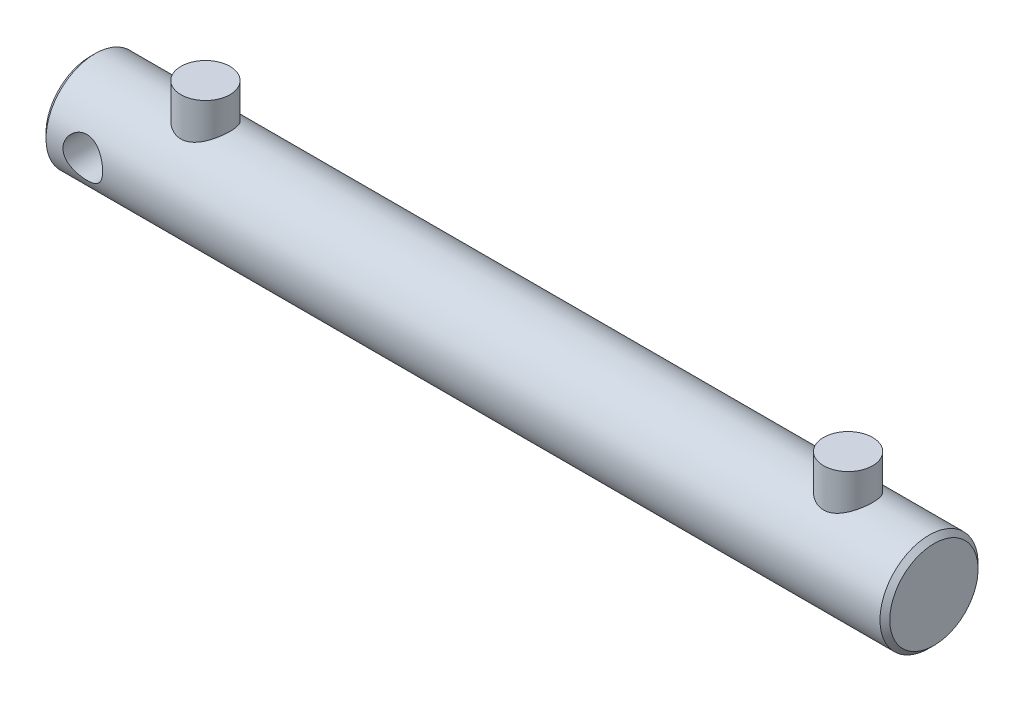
ISO-10303-21;
HEADER;
FILE_DESCRIPTION(('STEP AP214'),'2;1');
FILE_NAME('part.step','',(''),(''),'','','');
FILE_SCHEMA(('AUTOMOTIVE_DESIGN { 1 0 10303 214 1 1 1 1 }'));
ENDSEC;
DATA;
#1=APPLICATION_CONTEXT('core data for automotive mechanical design processes');
#2=APPLICATION_PROTOCOL_DEFINITION('international standard','automotive_design',2000,#1);
#3=PRODUCT_CONTEXT('',#1,'mechanical');
#4=PRODUCT('Part','Part','',(#3));
#5=PRODUCT_RELATED_PRODUCT_CATEGORY('part','',(#4));
#6=PRODUCT_DEFINITION_FORMATION('','',#4);
#7=PRODUCT_DEFINITION_CONTEXT('part definition',#1,'design');
#8=PRODUCT_DEFINITION('design','',#6,#7);
#9=PRODUCT_DEFINITION_SHAPE('','',#8);
#10=(LENGTH_UNIT() NAMED_UNIT(*) SI_UNIT(.MILLI.,.METRE.));
#11=(NAMED_UNIT(*) PLANE_ANGLE_UNIT() SI_UNIT($,.RADIAN.));
#12=(NAMED_UNIT(*) SI_UNIT($,.STERADIAN.) SOLID_ANGLE_UNIT());
#13=UNCERTAINTY_MEASURE_WITH_UNIT(LENGTH_MEASURE(1.E-05),#10,'distance_accuracy_value','');
#14=(GEOMETRIC_REPRESENTATION_CONTEXT(3) GLOBAL_UNCERTAINTY_ASSIGNED_CONTEXT((#13)) GLOBAL_UNIT_ASSIGNED_CONTEXT((#10,
#11,#12)) REPRESENTATION_CONTEXT('',''));
#15=CARTESIAN_POINT('',(0.,0.,0.));
#16=DIRECTION('',(0.,0.,1.));
#17=DIRECTION('',(1.,0.,0.));
#18=AXIS2_PLACEMENT_3D('',#15,#16,#17);
#19=CARTESIAN_POINT('',(-172.,0.,0.));
#20=DIRECTION('',(-1.,0.,0.));
#21=DIRECTION('',(0.,0.,1.));
#22=AXIS2_PLACEMENT_3D('',#19,#20,#21);
#23=CYLINDRICAL_SURFACE('',#22,20.);
#24=CARTESIAN_POINT('',(-125.,17.3205080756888,-9.99999999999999));
#25=CARTESIAN_POINT('',(-125.260663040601,17.3205095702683,-9.99999887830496));
#26=CARTESIAN_POINT('',(-125.521348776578,17.3264124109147,-9.98979463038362));
#27=CARTESIAN_POINT('',(-126.040711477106,17.3498046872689,-9.94911125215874));
#28=CARTESIAN_POINT('',(-126.299387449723,17.3672995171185,-9.91862268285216));
#29=CARTESIAN_POINT('',(-126.813023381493,17.4132568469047,-9.8377155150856));
#30=CARTESIAN_POINT('',(-127.06797685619,17.4417365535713,-9.78726564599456));
#31=CARTESIAN_POINT('',(-127.572049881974,17.5086546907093,-9.66704369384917));
#32=CARTESIAN_POINT('',(-127.821166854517,17.5470974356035,-9.59726323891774));
#33=CARTESIAN_POINT('',(-128.310473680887,17.6323996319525,-9.43962165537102));
#34=CARTESIAN_POINT('',(-128.550706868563,17.6792090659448,-9.3518675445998));
#35=CARTESIAN_POINT('',(-129.022554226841,17.779982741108,-9.15882440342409));
#36=CARTESIAN_POINT('',(-129.254165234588,17.8339495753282,-9.05352901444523));
#37=CARTESIAN_POINT('',(-129.707545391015,17.9475017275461,-8.82628481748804));
#38=CARTESIAN_POINT('',(-129.929316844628,18.007085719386,-8.70433993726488));
#39=CARTESIAN_POINT('',(-130.362159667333,18.1303531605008,-8.44458163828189));
#40=CARTESIAN_POINT('',(-130.573230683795,18.1940367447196,-8.3067676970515));
#41=CARTESIAN_POINT('',(-131.000837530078,18.329363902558,-8.00400718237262));
#42=CARTESIAN_POINT('',(-131.216382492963,18.4012302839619,-7.83775940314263));
#43=CARTESIAN_POINT('',(-131.632934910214,18.5460965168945,-7.48852658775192));
#44=CARTESIAN_POINT('',(-131.833946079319,18.6190960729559,-7.3055458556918));
#45=CARTESIAN_POINT('',(-132.220694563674,18.7644955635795,-6.92354675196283));
#46=CARTESIAN_POINT('',(-132.406419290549,18.836894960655,-6.72451542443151));
#47=CARTESIAN_POINT('',(-132.761346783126,18.9792540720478,-6.31154503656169));
#48=CARTESIAN_POINT('',(-132.930555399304,19.0492146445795,-6.09761130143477));
#49=CARTESIAN_POINT('',(-133.262364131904,19.1896470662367,-5.64077435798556));
#50=CARTESIAN_POINT('',(-133.423739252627,19.2598322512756,-5.39689043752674));
#51=CARTESIAN_POINT('',(-133.725206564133,19.3935808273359,-4.89454568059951));
#52=CARTESIAN_POINT('',(-133.865297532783,19.4571438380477,-4.63608400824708));
#53=CARTESIAN_POINT('',(-134.122748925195,19.5757886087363,-4.10635184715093));
#54=CARTESIAN_POINT('',(-134.240120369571,19.6308744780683,-3.83508764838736));
#55=CARTESIAN_POINT('',(-134.450862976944,19.7309453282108,-3.28159286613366));
#56=CARTESIAN_POINT('',(-134.544236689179,19.775931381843,-2.99936345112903));
#57=CARTESIAN_POINT('',(-134.700028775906,19.8516061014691,-2.44661617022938));
#58=CARTESIAN_POINT('',(-134.764176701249,19.8830841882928,-2.1766933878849));
#59=CARTESIAN_POINT('',(-134.869930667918,19.9352303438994,-1.63143316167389));
#60=CARTESIAN_POINT('',(-134.911537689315,19.9558988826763,-1.35609595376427));
#61=CARTESIAN_POINT('',(-134.971639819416,19.9858180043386,-0.802434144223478));
#62=CARTESIAN_POINT('',(-134.990146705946,19.9950744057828,-0.524111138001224));
#63=CARTESIAN_POINT('',(-135.003828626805,20.001913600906,0.0332441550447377));
#64=CARTESIAN_POINT('',(-134.999005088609,19.9994971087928,0.312276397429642));
#65=CARTESIAN_POINT('',(-134.967536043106,19.9837839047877,0.844365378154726));
#66=CARTESIAN_POINT('',(-134.942827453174,19.9714530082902,1.09756809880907));
#67=CARTESIAN_POINT('',(-134.874317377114,19.9374335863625,1.60072224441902));
#68=CARTESIAN_POINT('',(-134.830517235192,19.9157457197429,1.85067389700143));
#69=CARTESIAN_POINT('',(-134.724300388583,19.8635314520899,2.34564683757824));
#70=CARTESIAN_POINT('',(-134.66188307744,19.8330047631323,2.59066796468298));
#71=CARTESIAN_POINT('',(-134.519069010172,19.7638249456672,3.0742307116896));
#72=CARTESIAN_POINT('',(-134.438671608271,19.7251715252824,3.31277209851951));
#73=CARTESIAN_POINT('',(-134.259427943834,19.6400278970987,3.78519130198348));
#74=CARTESIAN_POINT('',(-134.160345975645,19.5934383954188,4.01896179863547));
#75=CARTESIAN_POINT('',(-133.945309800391,19.4938328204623,4.47722728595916));
#76=CARTESIAN_POINT('',(-133.829349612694,19.4408144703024,4.70171895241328));
#77=CARTESIAN_POINT('',(-133.457485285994,19.2738101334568,5.35951935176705));
#78=CARTESIAN_POINT('',(-133.17748838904,19.1518214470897,5.77743819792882));
#79=CARTESIAN_POINT('',(-132.530959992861,18.8844067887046,6.6018551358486));
#80=CARTESIAN_POINT('',(-132.158750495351,18.7378553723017,7.00353936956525));
#81=CARTESIAN_POINT('',(-131.55536158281,18.5185765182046,7.55658054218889));
#82=CARTESIAN_POINT('',(-131.346548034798,18.4455210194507,7.73279224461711));
#83=CARTESIAN_POINT('',(-130.914677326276,18.301419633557,8.06791510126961));
#84=CARTESIAN_POINT('',(-130.691618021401,18.2303740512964,8.22682364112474));
#85=CARTESIAN_POINT('',(-130.217666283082,18.0878347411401,8.53586780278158));
#86=CARTESIAN_POINT('',(-129.965906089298,18.0166021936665,8.68479491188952));
#87=CARTESIAN_POINT('',(-129.448949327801,17.8810231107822,8.96061518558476));
#88=CARTESIAN_POINT('',(-129.183758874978,17.8166734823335,9.08751826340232));
#89=CARTESIAN_POINT('',(-128.64159710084,17.6972138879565,9.31801905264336));
#90=CARTESIAN_POINT('',(-128.364632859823,17.6420984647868,9.42163054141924));
#91=CARTESIAN_POINT('',(-127.800756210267,17.5432965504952,9.6043511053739));
#92=CARTESIAN_POINT('',(-127.513845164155,17.4996085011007,9.68346352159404));
#93=CARTESIAN_POINT('',(-126.955495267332,17.4285246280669,9.81078056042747));
#94=CARTESIAN_POINT('',(-126.684630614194,17.400112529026,9.86093677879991));
#95=CARTESIAN_POINT('',(-126.13867425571,17.3557653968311,9.93878416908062));
#96=CARTESIAN_POINT('',(-125.863582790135,17.3398296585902,9.96647661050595));
#97=CARTESIAN_POINT('',(-125.311769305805,17.3211203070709,9.99895720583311));
#98=CARTESIAN_POINT('',(-125.035048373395,17.3183387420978,10.0037591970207));
#99=CARTESIAN_POINT('',(-124.482357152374,17.3260388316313,9.99041751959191));
#100=CARTESIAN_POINT('',(-124.206386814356,17.3365195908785,9.97227539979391));
#101=CARTESIAN_POINT('',(-123.687830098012,17.3684286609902,9.91658048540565));
#102=CARTESIAN_POINT('',(-123.444904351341,17.3885290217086,9.8813769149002));
#103=CARTESIAN_POINT('',(-122.963158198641,17.4382137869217,9.79342893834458));
#104=CARTESIAN_POINT('',(-122.724339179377,17.467801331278,9.74067872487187));
#105=CARTESIAN_POINT('',(-122.25237280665,17.5355331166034,9.61821012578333));
#106=CARTESIAN_POINT('',(-122.019224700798,17.5736762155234,9.54849400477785));
#107=CARTESIAN_POINT('',(-121.55977565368,17.6574071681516,9.39275103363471));
#108=CARTESIAN_POINT('',(-121.33347746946,17.7029979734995,9.3067177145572));
#109=CARTESIAN_POINT('',(-120.646161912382,17.8535843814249,9.01657018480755));
#110=CARTESIAN_POINT('',(-120.19832719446,17.9691397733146,8.78600743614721));
#111=CARTESIAN_POINT('',(-119.34518986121,18.2156365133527,8.26280380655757));
#112=CARTESIAN_POINT('',(-118.93990925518,18.3465857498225,7.97013103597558));
#113=CARTESIAN_POINT('',(-118.344589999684,18.5540860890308,7.46888401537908));
#114=CARTESIAN_POINT('',(-118.137806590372,18.6294365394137,7.27935116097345));
#115=CARTESIAN_POINT('',(-117.740757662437,18.7793184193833,6.88345408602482));
#116=CARTESIAN_POINT('',(-117.550487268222,18.8538500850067,6.6770948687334));
#117=CARTESIAN_POINT('',(-117.18740551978,19.0002370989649,6.2483870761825));
#118=CARTESIAN_POINT('',(-117.014607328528,19.0720904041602,6.02602665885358));
#119=CARTESIAN_POINT('',(-116.687849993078,19.2111944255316,5.5666478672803));
#120=CARTESIAN_POINT('',(-116.533882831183,19.2784470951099,5.32963579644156));
#121=CARTESIAN_POINT('',(-116.2420643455,19.4083463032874,4.83560208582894));
#122=CARTESIAN_POINT('',(-116.104754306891,19.4708214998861,4.5782147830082));
#123=CARTESIAN_POINT('',(-115.852529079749,19.5873354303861,4.05082787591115));
#124=CARTESIAN_POINT('',(-115.737614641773,19.6413738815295,3.78082784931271));
#125=CARTESIAN_POINT('',(-115.531567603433,19.7393769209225,3.23033940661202));
#126=CARTESIAN_POINT('',(-115.440418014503,19.7833487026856,2.94985864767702));
#127=CARTESIAN_POINT('',(-115.282980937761,19.8599022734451,2.38049331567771));
#128=CARTESIAN_POINT('',(-115.216690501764,19.8924854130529,2.09160974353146));
#129=CARTESIAN_POINT('',(-115.114810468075,19.9427983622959,1.53480500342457));
#130=CARTESIAN_POINT('',(-115.076961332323,19.9616170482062,1.26739371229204));
#131=CARTESIAN_POINT('',(-115.023013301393,19.9884894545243,0.729851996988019));
#132=CARTESIAN_POINT('',(-115.006913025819,19.9965438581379,0.459721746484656));
#133=CARTESIAN_POINT('',(-114.996673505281,20.0016629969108,-0.0809759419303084));
#134=CARTESIAN_POINT('',(-115.002527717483,19.998731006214,-0.351543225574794));
#135=CARTESIAN_POINT('',(-115.036105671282,19.9819662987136,-0.89097156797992));
#136=CARTESIAN_POINT('',(-115.063828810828,19.9681338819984,-1.1598326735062));
#137=CARTESIAN_POINT('',(-115.13824007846,19.9312153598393,-1.67605139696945));
#138=CARTESIAN_POINT('',(-115.18355535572,19.9088004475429,-1.92365683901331));
#139=CARTESIAN_POINT('',(-115.292457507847,19.8553300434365,-2.41384547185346));
#140=CARTESIAN_POINT('',(-115.356043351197,19.8242750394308,-2.6564289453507));
#141=CARTESIAN_POINT('',(-115.500847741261,19.7542370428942,-3.13506320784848));
#142=CARTESIAN_POINT('',(-115.582064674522,19.7152547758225,-3.37111459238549));
#143=CARTESIAN_POINT('',(-115.761430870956,19.6302044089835,-3.83546861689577));
#144=CARTESIAN_POINT('',(-115.859586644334,19.5841335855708,-4.06376823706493));
#145=CARTESIAN_POINT('',(-116.076518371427,19.483810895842,-4.52085803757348));
#146=CARTESIAN_POINT('',(-116.1959918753,19.4292950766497,-4.74925902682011));
#147=CARTESIAN_POINT('',(-116.451565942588,19.3148302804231,-5.19522438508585));
#148=CARTESIAN_POINT('',(-116.587672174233,19.2548794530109,-5.41278502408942));
#149=CARTESIAN_POINT('',(-116.875596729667,19.1308402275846,-5.83606045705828));
#150=CARTESIAN_POINT('',(-117.027418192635,19.0667510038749,-6.04177287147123));
#151=CARTESIAN_POINT('',(-117.345875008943,18.9358010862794,-6.44045588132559));
#152=CARTESIAN_POINT('',(-117.5125111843,18.8689402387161,-6.63342576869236));
#153=CARTESIAN_POINT('',(-117.877095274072,18.7271146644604,-7.02443076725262));
#154=CARTESIAN_POINT('',(-118.076508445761,18.6520069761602,-7.22105023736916));
#155=CARTESIAN_POINT('',(-118.491110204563,18.5021161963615,-7.59688252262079));
#156=CARTESIAN_POINT('',(-118.706294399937,18.4273330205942,-7.77610015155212));
#157=CARTESIAN_POINT('',(-119.151667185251,18.2800108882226,-8.11637930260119));
#158=CARTESIAN_POINT('',(-119.381870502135,18.2074742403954,-8.27742256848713));
#159=CARTESIAN_POINT('',(-119.856021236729,18.0668000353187,-8.58012843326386));
#160=CARTESIAN_POINT('',(-120.09997058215,17.9986630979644,-8.72178830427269));
#161=CARTESIAN_POINT('',(-120.60837449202,17.8668466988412,-8.98880823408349));
#162=CARTESIAN_POINT('',(-120.873235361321,17.8033795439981,-9.11350193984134));
#163=CARTESIAN_POINT('',(-121.414528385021,17.6857538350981,-9.33972032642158));
#164=CARTESIAN_POINT('',(-121.690954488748,17.6315904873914,-9.44125694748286));
#165=CARTESIAN_POINT('',(-122.252811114,17.5348420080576,-9.61975104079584));
#166=CARTESIAN_POINT('',(-122.538216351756,17.4922271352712,-9.69677174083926));
#167=CARTESIAN_POINT('',(-123.116185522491,17.420295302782,-9.82541504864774));
#168=CARTESIAN_POINT('',(-123.408744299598,17.3909690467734,-9.87705541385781));
#169=CARTESIAN_POINT('',(-123.917995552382,17.3529508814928,-9.94364603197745));
#170=CARTESIAN_POINT('',(-124.133648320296,17.340814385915,-9.96475859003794));
#171=CARTESIAN_POINT('',(-124.566195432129,17.3245920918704,-9.99293651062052));
#172=CARTESIAN_POINT('',(-124.783089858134,17.3205068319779,-10.0000009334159));
#173=CARTESIAN_POINT('',(-125.,17.3205080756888,-9.99999999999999));
#174=B_SPLINE_CURVE_WITH_KNOTS('',3,(#24,#25,#26,#27,#28,#29,#30,#31,#32,#33,#34,#35,#36,#37,
#38,#39,#40,#41,#42,#43,#44,#45,#46,#47,#48,#49,#50,#51,#52,#53,#54,#55,#56,#57,#58,#59,#60,#61,
#62,#63,#64,#65,#66,#67,#68,#69,#70,#71,#72,#73,#74,#75,#76,#77,#78,#79,#80,#81,#82,#83,#84,#85,
#86,#87,#88,#89,#90,#91,#92,#93,#94,#95,#96,#97,#98,#99,#100,#101,#102,#103,#104,#105,#106,#107,
#108,#109,#110,#111,#112,#113,#114,#115,#116,#117,#118,#119,#120,#121,#122,#123,#124,#125,#126,
#127,#128,#129,#130,#131,#132,#133,#134,#135,#136,#137,#138,#139,#140,#141,#142,#143,#144,#145,
#146,#147,#148,#149,#150,#151,#152,#153,#154,#155,#156,#157,#158,#159,#160,#161,#162,#163,#164,
#165,#166,#167,#168,#169,#170,#171,#172,#173),.UNSPECIFIED.,.T.,.F.,(4,2,2,2,2,2,2,2,2,2,2,2,2,
2,2,2,2,2,2,2,2,2,2,2,2,2,2,2,2,2,2,2,2,2,2,2,2,2,2,2,2,2,2,2,2,2,2,2,2,2,2,2,2,2,2,2,2,2,2,2,2,
2,2,2,2,2,2,2,2,2,2,2,2,2,4),(0.,0.781764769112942,1.56389357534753,2.34725251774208,
3.13095125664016,3.91011273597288,4.68955727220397,5.46881824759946,6.248104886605,
7.09181817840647,7.93531505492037,8.77949974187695,9.62338430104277,10.5244589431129,
11.4255853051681,12.3262734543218,13.2268658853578,14.0633930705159,14.8998838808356,
15.735948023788,16.571961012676,17.3351709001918,18.0983270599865,18.8615080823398,
19.6247165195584,20.3982891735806,21.1721366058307,22.7189130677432,24.411902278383,
25.2596540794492,26.1075337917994,27.0095657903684,27.9111907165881,28.8122809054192,
29.7132481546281,30.542861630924,31.3724282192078,32.2014932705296,33.0305023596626,
33.7685142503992,34.5067706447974,35.244928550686,35.9833797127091,37.5272041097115,
39.0718230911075,39.9423348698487,40.8125887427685,41.6834934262,42.5540260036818,
43.4478458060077,44.3416955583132,45.2349045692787,46.1280076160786,46.9391312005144,
47.7502033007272,48.5610337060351,49.371841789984,50.1291222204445,50.8863599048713,
51.6435283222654,52.4009883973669,53.1905472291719,53.980375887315,54.7703626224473,
55.5603932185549,56.4292490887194,57.297863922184,58.1673436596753,59.03694563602,
59.9343645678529,60.8313197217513,61.7259424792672,62.6199384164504,63.2704386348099,
63.9209823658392),.UNSPECIFIED.);
#175=CARTESIAN_POINT('',(-125.,17.3205080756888,-9.99999999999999));
#176=VERTEX_POINT('',#175);
#177=EDGE_CURVE('E38',#176,#176,#174,.T.);
#178=ORIENTED_EDGE('',*,*,#177,.F.);
#179=EDGE_LOOP('',(#178));
#180=FACE_BOUND('',#179,.T.);
#181=CARTESIAN_POINT('',(-146.9,0.,-20.));
#182=CARTESIAN_POINT('',(-146.900001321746,0.217553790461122,-19.9999989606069));
#183=CARTESIAN_POINT('',(-146.908776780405,0.435188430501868,-19.9964404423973));
#184=CARTESIAN_POINT('',(-146.943798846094,0.86891515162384,-19.9822953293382));
#185=CARTESIAN_POINT('',(-146.970056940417,1.08500612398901,-19.9717041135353));
#186=CARTESIAN_POINT('',(-147.039857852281,1.51445060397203,-19.9437418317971));
#187=CARTESIAN_POINT('',(-147.083440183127,1.72779669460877,-19.9263552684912));
#188=CARTESIAN_POINT('',(-147.187452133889,2.14972461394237,-19.8852614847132));
#189=CARTESIAN_POINT('',(-147.247882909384,2.35830611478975,-19.8615538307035));
#190=CARTESIAN_POINT('',(-147.384784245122,2.7685917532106,-19.8085220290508));
#191=CARTESIAN_POINT('',(-147.461199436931,2.97031690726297,-19.7792172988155));
#192=CARTESIAN_POINT('',(-147.629534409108,3.36638434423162,-19.7156711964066));
#193=CARTESIAN_POINT('',(-147.721454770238,3.56072635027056,-19.6814296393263));
#194=CARTESIAN_POINT('',(-147.920016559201,3.94078379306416,-19.6088661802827));
#195=CARTESIAN_POINT('',(-148.026649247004,4.12650426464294,-19.5705467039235));
#196=CARTESIAN_POINT('',(-148.253961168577,4.48850295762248,-19.4907084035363));
#197=CARTESIAN_POINT('',(-148.374645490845,4.66477772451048,-19.4491884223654));
#198=CARTESIAN_POINT('',(-148.634821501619,5.01438229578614,-19.3620718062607));
#199=CARTESIAN_POINT('',(-148.774904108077,5.18724787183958,-19.3163763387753));
#200=CARTESIAN_POINT('',(-149.068619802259,5.52069726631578,-19.2237314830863));
#201=CARTESIAN_POINT('',(-149.222253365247,5.68128065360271,-19.1767820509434));
#202=CARTESIAN_POINT('',(-149.542284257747,5.98938278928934,-19.0827999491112));
#203=CARTESIAN_POINT('',(-149.708689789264,6.13689300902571,-19.0357672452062));
#204=CARTESIAN_POINT('',(-150.053204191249,6.41783459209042,-18.9428953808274));
#205=CARTESIAN_POINT('',(-150.231309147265,6.55127062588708,-18.8970558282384));
#206=CARTESIAN_POINT('',(-150.606840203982,6.80914100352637,-18.8057217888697));
#207=CARTESIAN_POINT('',(-150.804779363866,6.932870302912,-18.760342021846));
#208=CARTESIAN_POINT('',(-151.21120099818,7.16306636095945,-18.6736608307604));
#209=CARTESIAN_POINT('',(-151.419679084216,7.26954022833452,-18.6323577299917));
#210=CARTESIAN_POINT('',(-151.845884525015,7.46434474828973,-18.555175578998));
#211=CARTESIAN_POINT('',(-152.063610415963,7.55267825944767,-18.5192956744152));
#212=CARTESIAN_POINT('',(-152.506807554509,7.7103371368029,-18.4542132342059));
#213=CARTESIAN_POINT('',(-152.732278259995,7.77966383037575,-18.4250102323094));
#214=CARTESIAN_POINT('',(-153.178677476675,7.89578945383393,-18.3755355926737));
#215=CARTESIAN_POINT('',(-153.399335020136,7.9434807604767,-18.3549138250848));
#216=CARTESIAN_POINT('',(-153.844442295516,8.0203294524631,-18.321464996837));
#217=CARTESIAN_POINT('',(-154.06889191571,8.04948738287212,-18.3086377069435));
#218=CARTESIAN_POINT('',(-154.519666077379,8.08890880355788,-18.2912553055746));
#219=CARTESIAN_POINT('',(-154.745989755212,8.09918055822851,-18.2866965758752));
#220=CARTESIAN_POINT('',(-155.198709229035,8.10072505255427,-18.2860126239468));
#221=CARTESIAN_POINT('',(-155.425105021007,8.09199871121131,-18.2898869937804));
#222=CARTESIAN_POINT('',(-155.859830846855,8.05697039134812,-18.3053422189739));
#223=CARTESIAN_POINT('',(-156.068288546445,8.03197836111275,-18.3163484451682));
#224=CARTESIAN_POINT('',(-156.482250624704,7.96598244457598,-18.3451470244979));
#225=CARTESIAN_POINT('',(-156.687753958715,7.92497303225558,-18.362941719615));
#226=CARTESIAN_POINT('',(-157.094312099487,7.82735937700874,-18.404761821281));
#227=CARTESIAN_POINT('',(-157.29536798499,7.77075896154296,-18.4287856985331));
#228=CARTESIAN_POINT('',(-157.691918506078,7.64244879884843,-18.4823647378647));
#229=CARTESIAN_POINT('',(-157.887410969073,7.57073323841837,-18.5119220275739));
#230=CARTESIAN_POINT('',(-158.275541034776,7.41119054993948,-18.5763775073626));
#231=CARTESIAN_POINT('',(-158.468040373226,7.32306621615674,-18.6113718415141));
#232=CARTESIAN_POINT('',(-158.845021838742,7.1323521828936,-18.6852885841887));
#233=CARTESIAN_POINT('',(-159.029501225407,7.02975758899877,-18.7242123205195));
#234=CARTESIAN_POINT('',(-159.389462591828,6.81080050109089,-18.8049623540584));
#235=CARTESIAN_POINT('',(-159.564943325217,6.69443610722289,-18.8467890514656));
#236=CARTESIAN_POINT('',(-159.90603190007,6.4486467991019,-18.932297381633));
#237=CARTESIAN_POINT('',(-160.071639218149,6.31922119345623,-18.975979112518));
#238=CARTESIAN_POINT('',(-160.404955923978,6.03720358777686,-19.0676654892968));
#239=CARTESIAN_POINT('',(-160.571781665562,5.88358742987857,-19.1157372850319));
#240=CARTESIAN_POINT('',(-160.891974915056,5.56290919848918,-19.2115077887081));
#241=CARTESIAN_POINT('',(-161.045346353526,5.39585107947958,-19.2592066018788));
#242=CARTESIAN_POINT('',(-161.337835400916,5.0490907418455,-19.3530089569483));
#243=CARTESIAN_POINT('',(-161.476944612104,4.86938117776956,-19.3991115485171));
#244=CARTESIAN_POINT('',(-161.739815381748,4.49850306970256,-19.4884538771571));
#245=CARTESIAN_POINT('',(-161.86358307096,4.30733914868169,-19.5316947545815));
#246=CARTESIAN_POINT('',(-162.097369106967,3.91043655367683,-19.6150570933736));
#247=CARTESIAN_POINT('',(-162.207039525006,3.70447453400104,-19.6550927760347));
#248=CARTESIAN_POINT('',(-162.408471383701,3.28314601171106,-19.729842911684));
#249=CARTESIAN_POINT('',(-162.500240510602,3.06778359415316,-19.7645596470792));
#250=CARTESIAN_POINT('',(-162.665018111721,2.62913934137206,-19.8276753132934));
#251=CARTESIAN_POINT('',(-162.738030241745,2.40585905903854,-19.8560754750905));
#252=CARTESIAN_POINT('',(-162.864528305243,1.95305901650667,-19.9057131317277));
#253=CARTESIAN_POINT('',(-162.918015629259,1.72353970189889,-19.926951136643));
#254=CARTESIAN_POINT('',(-163.002224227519,1.27415358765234,-19.9605660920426));
#255=CARTESIAN_POINT('',(-163.034125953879,1.05454166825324,-19.9734009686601));
#256=CARTESIAN_POINT('',(-163.079807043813,0.613140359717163,-19.9918193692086));
#257=CARTESIAN_POINT('',(-163.093587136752,0.391351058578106,-19.9974031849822));
#258=CARTESIAN_POINT('',(-163.102871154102,-0.0526198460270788,-20.0011625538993));
#259=CARTESIAN_POINT('',(-163.098379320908,-0.274801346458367,-19.9993398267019));
#260=CARTESIAN_POINT('',(-163.071179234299,-0.717859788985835,-19.9883410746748));
#261=CARTESIAN_POINT('',(-163.048471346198,-0.938736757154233,-19.9791651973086));
#262=CARTESIAN_POINT('',(-162.986569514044,-1.36724903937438,-19.954311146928));
#263=CARTESIAN_POINT('',(-162.948192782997,-1.57502190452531,-19.9389557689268));
#264=CARTESIAN_POINT('',(-162.855464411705,-1.98649733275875,-19.9021734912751));
#265=CARTESIAN_POINT('',(-162.801107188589,-2.19019844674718,-19.8807444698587));
#266=CARTESIAN_POINT('',(-162.676934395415,-2.59208434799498,-19.8323487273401));
#267=CARTESIAN_POINT('',(-162.607123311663,-2.79027071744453,-19.8053836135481));
#268=CARTESIAN_POINT('',(-162.452592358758,-3.18006963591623,-19.7465447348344));
#269=CARTESIAN_POINT('',(-162.367866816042,-3.371679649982,-19.7146691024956));
#270=CARTESIAN_POINT('',(-162.181383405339,-3.75288057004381,-19.6457256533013));
#271=CARTESIAN_POINT('',(-162.079186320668,-3.94223332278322,-19.6085295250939));
#272=CARTESIAN_POINT('',(-161.860392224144,-4.31174450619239,-19.5306049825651));
#273=CARTESIAN_POINT('',(-161.743790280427,-4.4918997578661,-19.4898753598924));
#274=CARTESIAN_POINT('',(-161.496967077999,-4.84203534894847,-19.4058526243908));
#275=CARTESIAN_POINT('',(-161.366743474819,-5.01201392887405,-19.3625590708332));
#276=CARTESIAN_POINT('',(-161.093473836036,-5.34090761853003,-19.2744311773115));
#277=CARTESIAN_POINT('',(-160.95042722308,-5.49982222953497,-19.2295967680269));
#278=CARTESIAN_POINT('',(-160.642171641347,-5.81617801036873,-19.1363810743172));
#279=CARTESIAN_POINT('',(-160.476117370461,-5.97278662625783,-19.0879656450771));
#280=CARTESIAN_POINT('',(-160.131317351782,-6.27149075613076,-18.9919197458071));
#281=CARTESIAN_POINT('',(-159.952575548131,-6.41359074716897,-18.9442890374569));
#282=CARTESIAN_POINT('',(-159.583258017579,-6.68251089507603,-18.8511091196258));
#283=CARTESIAN_POINT('',(-159.392675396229,-6.80932202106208,-18.8055611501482));
#284=CARTESIAN_POINT('',(-159.000949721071,-7.04661740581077,-18.7179373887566));
#285=CARTESIAN_POINT('',(-158.79981115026,-7.15710852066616,-18.6758601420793));
#286=CARTESIAN_POINT('',(-158.385735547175,-7.36211754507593,-18.5960069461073));
#287=CARTESIAN_POINT('',(-158.17268924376,-7.45643666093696,-18.5582861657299));
#288=CARTESIAN_POINT('',(-157.738475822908,-7.62660439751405,-18.4890062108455));
#289=CARTESIAN_POINT('',(-157.517312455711,-7.7024614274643,-18.4574442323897));
#290=CARTESIAN_POINT('',(-157.068484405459,-7.83492790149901,-18.4016053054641));
#291=CARTESIAN_POINT('',(-156.840822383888,-7.89154510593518,-18.3773254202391));
#292=CARTESIAN_POINT('',(-156.380747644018,-7.98489928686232,-18.3369567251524));
#293=CARTESIAN_POINT('',(-156.148335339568,-8.02163798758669,-18.3208672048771));
#294=CARTESIAN_POINT('',(-155.697962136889,-8.07281706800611,-18.2983698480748));
#295=CARTESIAN_POINT('',(-155.480195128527,-8.0886983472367,-18.2913371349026));
#296=CARTESIAN_POINT('',(-155.043982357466,-8.10281912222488,-18.2850864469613));
#297=CARTESIAN_POINT('',(-154.825536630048,-8.10105952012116,-18.2858680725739));
#298=CARTESIAN_POINT('',(-154.389698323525,-8.07992140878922,-18.2952179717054));
#299=CARTESIAN_POINT('',(-154.172305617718,-8.06054507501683,-18.3037852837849));
#300=CARTESIAN_POINT('',(-153.740212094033,-8.00439867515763,-18.3284079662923));
#301=CARTESIAN_POINT('',(-153.525511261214,-7.9676287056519,-18.3444632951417));
#302=CARTESIAN_POINT('',(-153.109281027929,-7.87899425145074,-18.3827003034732));
#303=CARTESIAN_POINT('',(-152.907576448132,-7.82782592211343,-18.4045974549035));
#304=CARTESIAN_POINT('',(-152.509277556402,-7.71034555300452,-18.4541223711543));
#305=CARTESIAN_POINT('',(-152.312685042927,-7.64402826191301,-18.4817521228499));
#306=CARTESIAN_POINT('',(-151.925853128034,-7.49682896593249,-18.5419489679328));
#307=CARTESIAN_POINT('',(-151.735612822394,-7.41594904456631,-18.5745153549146));
#308=CARTESIAN_POINT('',(-151.362404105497,-7.24019743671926,-18.6437243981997));
#309=CARTESIAN_POINT('',(-151.179438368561,-7.14532066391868,-18.6803685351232));
#310=CARTESIAN_POINT('',(-150.811381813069,-6.93634048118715,-18.7590072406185));
#311=CARTESIAN_POINT('',(-150.626782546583,-6.82144138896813,-18.8011888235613));
#312=CARTESIAN_POINT('',(-150.26777997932,-6.57747679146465,-18.8879208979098));
#313=CARTESIAN_POINT('',(-150.093377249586,-6.44841049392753,-18.9324715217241));
#314=CARTESIAN_POINT('',(-149.755596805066,-6.1768289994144,-19.0228091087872));
#315=CARTESIAN_POINT('',(-149.592223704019,-6.03430823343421,-19.0685965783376));
#316=CARTESIAN_POINT('',(-149.277481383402,-5.73669576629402,-19.1602337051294));
#317=CARTESIAN_POINT('',(-149.126108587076,-5.58160783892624,-19.2060833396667));
#318=CARTESIAN_POINT('',(-148.826319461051,-5.24873029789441,-19.2998110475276));
#319=CARTESIAN_POINT('',(-148.678795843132,-5.07011468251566,-19.3476165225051));
#320=CARTESIAN_POINT('',(-148.399354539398,-4.70054560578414,-19.4407090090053));
#321=CARTESIAN_POINT('',(-148.267431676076,-4.50959627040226,-19.4859968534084));
#322=CARTESIAN_POINT('',(-148.020029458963,-4.11631109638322,-19.5728526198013));
#323=CARTESIAN_POINT('',(-147.904562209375,-3.91396702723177,-19.6144177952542));
#324=CARTESIAN_POINT('',(-147.691166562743,-3.49932983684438,-19.6926175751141));
#325=CARTESIAN_POINT('',(-147.593236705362,-3.2870375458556,-19.7292525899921));
#326=CARTESIAN_POINT('',(-147.417418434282,-2.85784311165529,-19.7959350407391));
#327=CARTESIAN_POINT('',(-147.339201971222,-2.64109201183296,-19.8260888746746));
#328=CARTESIAN_POINT('',(-147.20135230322,-2.20096724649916,-19.8797603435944));
#329=CARTESIAN_POINT('',(-147.141717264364,-1.97759423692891,-19.9032786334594));
#330=CARTESIAN_POINT('',(-147.041807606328,-1.52656255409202,-19.9429368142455));
#331=CARTESIAN_POINT('',(-147.001481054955,-1.29891710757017,-19.959096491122));
#332=CARTESIAN_POINT('',(-146.94043734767,-0.840712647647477,-19.9836373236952));
#333=CARTESIAN_POINT('',(-146.919705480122,-0.610155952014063,-19.9920243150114));
#334=CARTESIAN_POINT('',(-146.905919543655,-0.316014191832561,-19.9976033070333));
#335=CARTESIAN_POINT('',(-146.903700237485,-0.252837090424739,-19.998501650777));
#336=CARTESIAN_POINT('',(-146.900740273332,-0.126442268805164,-19.9997001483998));
#337=CARTESIAN_POINT('',(-146.89999961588,-0.0632245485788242,-20.0000003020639));
#338=CARTESIAN_POINT('',(-146.9,0.,-20.));
#339=B_SPLINE_CURVE_WITH_KNOTS('',3,(#181,#182,#183,#184,#185,#186,#187,#188,#189,#190,#191,
#192,#193,#194,#195,#196,#197,#198,#199,#200,#201,#202,#203,#204,#205,#206,#207,#208,#209,#210,
#211,#212,#213,#214,#215,#216,#217,#218,#219,#220,#221,#222,#223,#224,#225,#226,#227,#228,#229,
#230,#231,#232,#233,#234,#235,#236,#237,#238,#239,#240,#241,#242,#243,#244,#245,#246,#247,#248,
#249,#250,#251,#252,#253,#254,#255,#256,#257,#258,#259,#260,#261,#262,#263,#264,#265,#266,#267,
#268,#269,#270,#271,#272,#273,#274,#275,#276,#277,#278,#279,#280,#281,#282,#283,#284,#285,#286,
#287,#288,#289,#290,#291,#292,#293,#294,#295,#296,#297,#298,#299,#300,#301,#302,#303,#304,#305,
#306,#307,#308,#309,#310,#311,#312,#313,#314,#315,#316,#317,#318,#319,#320,#321,#322,#323,#324,
#325,#326,#327,#328,#329,#330,#331,#332,#333,#334,#335,#336,#337,#338),.UNSPECIFIED.,.T.,.F.,(4,
2,2,2,2,2,2,2,2,2,2,2,2,2,2,2,2,2,2,2,2,2,2,2,2,2,2,2,2,2,2,2,2,2,2,2,2,2,2,2,2,2,2,2,2,2,2,2,2,
2,2,2,2,2,2,2,2,2,2,2,2,2,2,2,2,2,2,2,2,2,2,2,2,2,2,2,2,2,4),(0.,0.652596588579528,
1.30562240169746,1.96014626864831,2.61471503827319,3.2670529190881,3.91941523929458,
4.57139167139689,5.22360494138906,5.90428093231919,6.58498080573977,7.26612153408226,
7.94703551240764,8.65954656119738,9.37176332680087,10.0838677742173,10.7959224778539,
11.4750993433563,12.1542562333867,12.8331158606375,13.5119426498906,14.1419204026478,
14.7721156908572,15.4021564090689,16.0324398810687,16.6755035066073,17.3187851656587,
17.9621556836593,18.6055602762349,19.3002237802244,19.9946836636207,20.6895501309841,
21.3841380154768,22.0934810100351,22.8025187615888,23.5114182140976,24.2202671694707,
24.8862793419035,25.5522647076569,26.2180954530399,26.8839128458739,27.5187156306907,
28.1537404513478,28.788581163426,29.4236638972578,30.0780389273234,30.7326386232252,
31.3873511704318,32.0420932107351,32.7412878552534,33.4402660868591,34.139655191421,
34.8387496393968,35.5459021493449,36.252731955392,36.9592763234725,37.6657593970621,
38.3202973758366,38.9748018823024,39.6292255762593,40.283645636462,40.9106764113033,
41.5379248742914,42.1650836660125,42.7924709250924,43.4562239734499,44.1200141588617,
44.7840803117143,45.4479477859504,46.1567243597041,46.8652650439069,47.5743242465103,
48.2833243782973,48.9796040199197,49.67581491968,50.37014261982,51.0639486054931,
51.2536033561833,51.4432581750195),.UNSPECIFIED.);
#340=CARTESIAN_POINT('',(-146.9,0.,-20.));
#341=VERTEX_POINT('',#340);
#342=EDGE_CURVE('E42',#341,#341,#339,.T.);
#343=ORIENTED_EDGE('',*,*,#342,.T.);
#344=EDGE_LOOP('',(#343));
#345=FACE_BOUND('',#344,.T.);
#346=CARTESIAN_POINT('',(-146.9,0.,20.));
#347=CARTESIAN_POINT('',(-146.900001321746,-0.217553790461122,19.9999989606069));
#348=CARTESIAN_POINT('',(-146.908776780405,-0.435188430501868,19.9964404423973));
#349=CARTESIAN_POINT('',(-146.943798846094,-0.86891515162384,19.9822953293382));
#350=CARTESIAN_POINT('',(-146.970056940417,-1.08500612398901,19.9717041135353));
#351=CARTESIAN_POINT('',(-147.039857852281,-1.51445060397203,19.9437418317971));
#352=CARTESIAN_POINT('',(-147.083440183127,-1.72779669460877,19.9263552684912));
#353=CARTESIAN_POINT('',(-147.187452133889,-2.14972461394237,19.8852614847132));
#354=CARTESIAN_POINT('',(-147.247882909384,-2.35830611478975,19.8615538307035));
#355=CARTESIAN_POINT('',(-147.384784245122,-2.7685917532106,19.8085220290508));
#356=CARTESIAN_POINT('',(-147.461199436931,-2.97031690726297,19.7792172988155));
#357=CARTESIAN_POINT('',(-147.629534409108,-3.36638434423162,19.7156711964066));
#358=CARTESIAN_POINT('',(-147.721454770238,-3.56072635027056,19.6814296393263));
#359=CARTESIAN_POINT('',(-147.920016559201,-3.94078379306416,19.6088661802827));
#360=CARTESIAN_POINT('',(-148.026649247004,-4.12650426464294,19.5705467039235));
#361=CARTESIAN_POINT('',(-148.253961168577,-4.48850295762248,19.4907084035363));
#362=CARTESIAN_POINT('',(-148.374645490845,-4.66477772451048,19.4491884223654));
#363=CARTESIAN_POINT('',(-148.634821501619,-5.01438229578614,19.3620718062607));
#364=CARTESIAN_POINT('',(-148.774904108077,-5.18724787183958,19.3163763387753));
#365=CARTESIAN_POINT('',(-149.068619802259,-5.52069726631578,19.2237314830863));
#366=CARTESIAN_POINT('',(-149.222253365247,-5.68128065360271,19.1767820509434));
#367=CARTESIAN_POINT('',(-149.542284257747,-5.98938278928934,19.0827999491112));
#368=CARTESIAN_POINT('',(-149.708689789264,-6.13689300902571,19.0357672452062));
#369=CARTESIAN_POINT('',(-150.053204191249,-6.41783459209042,18.9428953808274));
#370=CARTESIAN_POINT('',(-150.231309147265,-6.55127062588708,18.8970558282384));
#371=CARTESIAN_POINT('',(-150.606840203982,-6.80914100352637,18.8057217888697));
#372=CARTESIAN_POINT('',(-150.804779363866,-6.932870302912,18.760342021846));
#373=CARTESIAN_POINT('',(-151.21120099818,-7.16306636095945,18.6736608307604));
#374=CARTESIAN_POINT('',(-151.419679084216,-7.26954022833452,18.6323577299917));
#375=CARTESIAN_POINT('',(-151.845884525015,-7.46434474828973,18.555175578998));
#376=CARTESIAN_POINT('',(-152.063610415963,-7.55267825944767,18.5192956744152));
#377=CARTESIAN_POINT('',(-152.506807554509,-7.7103371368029,18.4542132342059));
#378=CARTESIAN_POINT('',(-152.732278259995,-7.77966383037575,18.4250102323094));
#379=CARTESIAN_POINT('',(-153.178677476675,-7.89578945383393,18.3755355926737));
#380=CARTESIAN_POINT('',(-153.399335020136,-7.9434807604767,18.3549138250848));
#381=CARTESIAN_POINT('',(-153.844442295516,-8.0203294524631,18.321464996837));
#382=CARTESIAN_POINT('',(-154.06889191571,-8.04948738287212,18.3086377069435));
#383=CARTESIAN_POINT('',(-154.519666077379,-8.08890880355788,18.2912553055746));
#384=CARTESIAN_POINT('',(-154.745989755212,-8.09918055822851,18.2866965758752));
#385=CARTESIAN_POINT('',(-155.198709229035,-8.10072505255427,18.2860126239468));
#386=CARTESIAN_POINT('',(-155.425105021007,-8.09199871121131,18.2898869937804));
#387=CARTESIAN_POINT('',(-155.859830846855,-8.05697039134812,18.3053422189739));
#388=CARTESIAN_POINT('',(-156.068288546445,-8.03197836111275,18.3163484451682));
#389=CARTESIAN_POINT('',(-156.482250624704,-7.96598244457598,18.3451470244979));
#390=CARTESIAN_POINT('',(-156.687753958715,-7.92497303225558,18.362941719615));
#391=CARTESIAN_POINT('',(-157.094312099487,-7.82735937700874,18.404761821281));
#392=CARTESIAN_POINT('',(-157.29536798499,-7.77075896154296,18.4287856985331));
#393=CARTESIAN_POINT('',(-157.691918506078,-7.64244879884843,18.4823647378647));
#394=CARTESIAN_POINT('',(-157.887410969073,-7.57073323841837,18.5119220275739));
#395=CARTESIAN_POINT('',(-158.275541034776,-7.41119054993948,18.5763775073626));
#396=CARTESIAN_POINT('',(-158.468040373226,-7.32306621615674,18.6113718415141));
#397=CARTESIAN_POINT('',(-158.845021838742,-7.1323521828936,18.6852885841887));
#398=CARTESIAN_POINT('',(-159.029501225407,-7.02975758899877,18.7242123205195));
#399=CARTESIAN_POINT('',(-159.389462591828,-6.81080050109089,18.8049623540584));
#400=CARTESIAN_POINT('',(-159.564943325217,-6.69443610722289,18.8467890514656));
#401=CARTESIAN_POINT('',(-159.90603190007,-6.4486467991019,18.932297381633));
#402=CARTESIAN_POINT('',(-160.071639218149,-6.31922119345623,18.975979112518));
#403=CARTESIAN_POINT('',(-160.404955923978,-6.03720358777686,19.0676654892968));
#404=CARTESIAN_POINT('',(-160.571781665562,-5.88358742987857,19.1157372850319));
#405=CARTESIAN_POINT('',(-160.891974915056,-5.56290919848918,19.2115077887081));
#406=CARTESIAN_POINT('',(-161.045346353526,-5.39585107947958,19.2592066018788));
#407=CARTESIAN_POINT('',(-161.337835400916,-5.0490907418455,19.3530089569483));
#408=CARTESIAN_POINT('',(-161.476944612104,-4.86938117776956,19.3991115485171));
#409=CARTESIAN_POINT('',(-161.739815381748,-4.49850306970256,19.4884538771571));
#410=CARTESIAN_POINT('',(-161.86358307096,-4.30733914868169,19.5316947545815));
#411=CARTESIAN_POINT('',(-162.097369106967,-3.91043655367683,19.6150570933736));
#412=CARTESIAN_POINT('',(-162.207039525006,-3.70447453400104,19.6550927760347));
#413=CARTESIAN_POINT('',(-162.408471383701,-3.28314601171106,19.729842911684));
#414=CARTESIAN_POINT('',(-162.500240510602,-3.06778359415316,19.7645596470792));
#415=CARTESIAN_POINT('',(-162.665018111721,-2.62913934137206,19.8276753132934));
#416=CARTESIAN_POINT('',(-162.738030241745,-2.40585905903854,19.8560754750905));
#417=CARTESIAN_POINT('',(-162.864528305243,-1.95305901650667,19.9057131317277));
#418=CARTESIAN_POINT('',(-162.918015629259,-1.72353970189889,19.926951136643));
#419=CARTESIAN_POINT('',(-163.002224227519,-1.27415358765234,19.9605660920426));
#420=CARTESIAN_POINT('',(-163.034125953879,-1.05454166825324,19.9734009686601));
#421=CARTESIAN_POINT('',(-163.079807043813,-0.613140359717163,19.9918193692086));
#422=CARTESIAN_POINT('',(-163.093587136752,-0.391351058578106,19.9974031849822));
#423=CARTESIAN_POINT('',(-163.102871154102,0.0526198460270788,20.0011625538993));
#424=CARTESIAN_POINT('',(-163.098379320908,0.274801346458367,19.9993398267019));
#425=CARTESIAN_POINT('',(-163.071179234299,0.717859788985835,19.9883410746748));
#426=CARTESIAN_POINT('',(-163.048471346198,0.938736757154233,19.9791651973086));
#427=CARTESIAN_POINT('',(-162.986569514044,1.36724903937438,19.954311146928));
#428=CARTESIAN_POINT('',(-162.948192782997,1.57502190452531,19.9389557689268));
#429=CARTESIAN_POINT('',(-162.855464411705,1.98649733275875,19.9021734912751));
#430=CARTESIAN_POINT('',(-162.801107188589,2.19019844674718,19.8807444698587));
#431=CARTESIAN_POINT('',(-162.676934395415,2.59208434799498,19.8323487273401));
#432=CARTESIAN_POINT('',(-162.607123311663,2.79027071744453,19.8053836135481));
#433=CARTESIAN_POINT('',(-162.452592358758,3.18006963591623,19.7465447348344));
#434=CARTESIAN_POINT('',(-162.367866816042,3.371679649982,19.7146691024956));
#435=CARTESIAN_POINT('',(-162.181383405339,3.75288057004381,19.6457256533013));
#436=CARTESIAN_POINT('',(-162.079186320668,3.94223332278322,19.6085295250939));
#437=CARTESIAN_POINT('',(-161.860392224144,4.31174450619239,19.5306049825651));
#438=CARTESIAN_POINT('',(-161.743790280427,4.4918997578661,19.4898753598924));
#439=CARTESIAN_POINT('',(-161.496967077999,4.84203534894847,19.4058526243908));
#440=CARTESIAN_POINT('',(-161.366743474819,5.01201392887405,19.3625590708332));
#441=CARTESIAN_POINT('',(-161.093473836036,5.34090761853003,19.2744311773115));
#442=CARTESIAN_POINT('',(-160.95042722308,5.49982222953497,19.2295967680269));
#443=CARTESIAN_POINT('',(-160.642171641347,5.81617801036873,19.1363810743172));
#444=CARTESIAN_POINT('',(-160.476117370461,5.97278662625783,19.0879656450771));
#445=CARTESIAN_POINT('',(-160.131317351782,6.27149075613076,18.9919197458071));
#446=CARTESIAN_POINT('',(-159.952575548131,6.41359074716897,18.9442890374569));
#447=CARTESIAN_POINT('',(-159.583258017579,6.68251089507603,18.8511091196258));
#448=CARTESIAN_POINT('',(-159.392675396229,6.80932202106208,18.8055611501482));
#449=CARTESIAN_POINT('',(-159.000949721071,7.04661740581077,18.7179373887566));
#450=CARTESIAN_POINT('',(-158.79981115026,7.15710852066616,18.6758601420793));
#451=CARTESIAN_POINT('',(-158.385735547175,7.36211754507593,18.5960069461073));
#452=CARTESIAN_POINT('',(-158.17268924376,7.45643666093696,18.5582861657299));
#453=CARTESIAN_POINT('',(-157.738475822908,7.62660439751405,18.4890062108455));
#454=CARTESIAN_POINT('',(-157.517312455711,7.7024614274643,18.4574442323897));
#455=CARTESIAN_POINT('',(-157.068484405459,7.83492790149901,18.4016053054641));
#456=CARTESIAN_POINT('',(-156.840822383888,7.89154510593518,18.3773254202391));
#457=CARTESIAN_POINT('',(-156.380747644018,7.98489928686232,18.3369567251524));
#458=CARTESIAN_POINT('',(-156.148335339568,8.02163798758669,18.3208672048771));
#459=CARTESIAN_POINT('',(-155.697962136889,8.07281706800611,18.2983698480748));
#460=CARTESIAN_POINT('',(-155.480195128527,8.0886983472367,18.2913371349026));
#461=CARTESIAN_POINT('',(-155.043982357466,8.10281912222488,18.2850864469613));
#462=CARTESIAN_POINT('',(-154.825536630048,8.10105952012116,18.2858680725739));
#463=CARTESIAN_POINT('',(-154.389698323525,8.07992140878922,18.2952179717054));
#464=CARTESIAN_POINT('',(-154.172305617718,8.06054507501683,18.3037852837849));
#465=CARTESIAN_POINT('',(-153.740212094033,8.00439867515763,18.3284079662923));
#466=CARTESIAN_POINT('',(-153.525511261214,7.9676287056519,18.3444632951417));
#467=CARTESIAN_POINT('',(-153.109281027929,7.87899425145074,18.3827003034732));
#468=CARTESIAN_POINT('',(-152.907576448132,7.82782592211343,18.4045974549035));
#469=CARTESIAN_POINT('',(-152.509277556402,7.71034555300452,18.4541223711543));
#470=CARTESIAN_POINT('',(-152.312685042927,7.64402826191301,18.4817521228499));
#471=CARTESIAN_POINT('',(-151.925853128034,7.49682896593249,18.5419489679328));
#472=CARTESIAN_POINT('',(-151.735612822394,7.41594904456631,18.5745153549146));
#473=CARTESIAN_POINT('',(-151.362404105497,7.24019743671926,18.6437243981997));
#474=CARTESIAN_POINT('',(-151.179438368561,7.14532066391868,18.6803685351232));
#475=CARTESIAN_POINT('',(-150.811381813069,6.93634048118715,18.7590072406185));
#476=CARTESIAN_POINT('',(-150.626782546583,6.82144138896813,18.8011888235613));
#477=CARTESIAN_POINT('',(-150.26777997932,6.57747679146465,18.8879208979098));
#478=CARTESIAN_POINT('',(-150.093377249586,6.44841049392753,18.9324715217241));
#479=CARTESIAN_POINT('',(-149.755596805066,6.1768289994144,19.0228091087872));
#480=CARTESIAN_POINT('',(-149.592223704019,6.03430823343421,19.0685965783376));
#481=CARTESIAN_POINT('',(-149.277481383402,5.73669576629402,19.1602337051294));
#482=CARTESIAN_POINT('',(-149.126108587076,5.58160783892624,19.2060833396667));
#483=CARTESIAN_POINT('',(-148.826319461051,5.24873029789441,19.2998110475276));
#484=CARTESIAN_POINT('',(-148.678795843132,5.07011468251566,19.3476165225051));
#485=CARTESIAN_POINT('',(-148.399354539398,4.70054560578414,19.4407090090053));
#486=CARTESIAN_POINT('',(-148.267431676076,4.50959627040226,19.4859968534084));
#487=CARTESIAN_POINT('',(-148.020029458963,4.11631109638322,19.5728526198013));
#488=CARTESIAN_POINT('',(-147.904562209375,3.91396702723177,19.6144177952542));
#489=CARTESIAN_POINT('',(-147.691166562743,3.49932983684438,19.6926175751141));
#490=CARTESIAN_POINT('',(-147.593236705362,3.2870375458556,19.7292525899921));
#491=CARTESIAN_POINT('',(-147.417418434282,2.85784311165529,19.7959350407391));
#492=CARTESIAN_POINT('',(-147.339201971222,2.64109201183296,19.8260888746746));
#493=CARTESIAN_POINT('',(-147.20135230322,2.20096724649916,19.8797603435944));
#494=CARTESIAN_POINT('',(-147.141717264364,1.97759423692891,19.9032786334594));
#495=CARTESIAN_POINT('',(-147.041807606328,1.52656255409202,19.9429368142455));
#496=CARTESIAN_POINT('',(-147.001481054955,1.29891710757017,19.959096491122));
#497=CARTESIAN_POINT('',(-146.94043734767,0.840712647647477,19.9836373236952));
#498=CARTESIAN_POINT('',(-146.919705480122,0.610155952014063,19.9920243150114));
#499=CARTESIAN_POINT('',(-146.905919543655,0.316014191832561,19.9976033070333));
#500=CARTESIAN_POINT('',(-146.903700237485,0.252837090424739,19.998501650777));
#501=CARTESIAN_POINT('',(-146.900740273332,0.126442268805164,19.9997001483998));
#502=CARTESIAN_POINT('',(-146.89999961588,0.0632245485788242,20.0000003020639));
#503=CARTESIAN_POINT('',(-146.9,0.,20.));
#504=B_SPLINE_CURVE_WITH_KNOTS('',3,(#346,#347,#348,#349,#350,#351,#352,#353,#354,#355,#356,
#357,#358,#359,#360,#361,#362,#363,#364,#365,#366,#367,#368,#369,#370,#371,#372,#373,#374,#375,
#376,#377,#378,#379,#380,#381,#382,#383,#384,#385,#386,#387,#388,#389,#390,#391,#392,#393,#394,
#395,#396,#397,#398,#399,#400,#401,#402,#403,#404,#405,#406,#407,#408,#409,#410,#411,#412,#413,
#414,#415,#416,#417,#418,#419,#420,#421,#422,#423,#424,#425,#426,#427,#428,#429,#430,#431,#432,
#433,#434,#435,#436,#437,#438,#439,#440,#441,#442,#443,#444,#445,#446,#447,#448,#449,#450,#451,
#452,#453,#454,#455,#456,#457,#458,#459,#460,#461,#462,#463,#464,#465,#466,#467,#468,#469,#470,
#471,#472,#473,#474,#475,#476,#477,#478,#479,#480,#481,#482,#483,#484,#485,#486,#487,#488,#489,
#490,#491,#492,#493,#494,#495,#496,#497,#498,#499,#500,#501,#502,#503),.UNSPECIFIED.,.T.,.F.,(4,
2,2,2,2,2,2,2,2,2,2,2,2,2,2,2,2,2,2,2,2,2,2,2,2,2,2,2,2,2,2,2,2,2,2,2,2,2,2,2,2,2,2,2,2,2,2,2,2,
2,2,2,2,2,2,2,2,2,2,2,2,2,2,2,2,2,2,2,2,2,2,2,2,2,2,2,2,2,4),(0.,0.652596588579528,
1.30562240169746,1.96014626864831,2.61471503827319,3.2670529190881,3.91941523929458,
4.57139167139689,5.22360494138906,5.90428093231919,6.58498080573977,7.26612153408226,
7.94703551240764,8.65954656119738,9.37176332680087,10.0838677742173,10.7959224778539,
11.4750993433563,12.1542562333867,12.8331158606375,13.5119426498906,14.1419204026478,
14.7721156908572,15.4021564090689,16.0324398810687,16.6755035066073,17.3187851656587,
17.9621556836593,18.6055602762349,19.3002237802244,19.9946836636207,20.6895501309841,
21.3841380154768,22.0934810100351,22.8025187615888,23.5114182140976,24.2202671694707,
24.8862793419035,25.5522647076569,26.2180954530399,26.8839128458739,27.5187156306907,
28.1537404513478,28.788581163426,29.4236638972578,30.0780389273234,30.7326386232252,
31.3873511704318,32.0420932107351,32.7412878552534,33.4402660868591,34.139655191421,
34.8387496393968,35.5459021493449,36.252731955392,36.9592763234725,37.6657593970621,
38.3202973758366,38.9748018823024,39.6292255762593,40.283645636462,40.9106764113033,
41.5379248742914,42.1650836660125,42.7924709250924,43.4562239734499,44.1200141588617,
44.7840803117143,45.4479477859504,46.1567243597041,46.8652650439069,47.5743242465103,
48.2833243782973,48.9796040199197,49.67581491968,50.37014261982,51.0639486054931,
51.2536033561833,51.4432581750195),.UNSPECIFIED.);
#505=CARTESIAN_POINT('',(-146.9,0.,20.));
#506=VERTEX_POINT('',#505);
#507=EDGE_CURVE('E46',#506,#506,#504,.T.);
#508=ORIENTED_EDGE('',*,*,#507,.T.);
#509=EDGE_LOOP('',(#508));
#510=FACE_BOUND('',#509,.T.);
#511=CARTESIAN_POINT('',(170.,0.,0.));
#512=DIRECTION('',(-1.,0.,0.));
#513=DIRECTION('',(0.,0.,1.));
#514=AXIS2_PLACEMENT_3D('',#511,#512,#513);
#515=CIRCLE('',#514,20.);
#516=CARTESIAN_POINT('',(170.,0.,20.));
#517=VERTEX_POINT('',#516);
#518=EDGE_CURVE('E81',#517,#517,#515,.T.);
#519=ORIENTED_EDGE('',*,*,#518,.T.);
#520=EDGE_LOOP('',(#519));
#521=FACE_BOUND('',#520,.T.);
#522=CARTESIAN_POINT('',(-170.,0.,0.));
#523=DIRECTION('',(1.,0.,0.));
#524=DIRECTION('',(0.,0.,-1.));
#525=AXIS2_PLACEMENT_3D('',#522,#523,#524);
#526=CIRCLE('',#525,20.);
#527=CARTESIAN_POINT('',(-170.,0.,-20.));
#528=VERTEX_POINT('',#527);
#529=EDGE_CURVE('E84',#528,#528,#526,.T.);
#530=ORIENTED_EDGE('',*,*,#529,.T.);
#531=EDGE_LOOP('',(#530));
#532=FACE_BOUND('',#531,.T.);
#533=CARTESIAN_POINT('',(137.,17.3205080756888,-10.));
#534=CARTESIAN_POINT('',(136.739336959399,17.3205095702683,-9.99999887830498));
#535=CARTESIAN_POINT('',(136.478651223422,17.3264124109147,-9.98979463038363));
#536=CARTESIAN_POINT('',(135.959288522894,17.3498046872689,-9.94911125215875));
#537=CARTESIAN_POINT('',(135.700612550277,17.3672995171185,-9.91862268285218));
#538=CARTESIAN_POINT('',(135.186976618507,17.4132568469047,-9.83771551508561));
#539=CARTESIAN_POINT('',(134.93202314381,17.4417365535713,-9.78726564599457));
#540=CARTESIAN_POINT('',(134.427950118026,17.5086546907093,-9.66704369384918));
#541=CARTESIAN_POINT('',(134.178833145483,17.5470974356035,-9.59726323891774));
#542=CARTESIAN_POINT('',(133.689526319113,17.6323996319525,-9.43962165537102));
#543=CARTESIAN_POINT('',(133.449293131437,17.6792090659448,-9.35186754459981));
#544=CARTESIAN_POINT('',(132.977445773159,17.779982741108,-9.1588244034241));
#545=CARTESIAN_POINT('',(132.745834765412,17.8339495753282,-9.05352901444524));
#546=CARTESIAN_POINT('',(132.292454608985,17.9475017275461,-8.82628481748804));
#547=CARTESIAN_POINT('',(132.070683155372,18.007085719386,-8.70433993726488));
#548=CARTESIAN_POINT('',(131.637840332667,18.1303531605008,-8.44458163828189));
#549=CARTESIAN_POINT('',(131.426769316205,18.1940367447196,-8.3067676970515));
#550=CARTESIAN_POINT('',(130.999162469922,18.329363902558,-8.00400718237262));
#551=CARTESIAN_POINT('',(130.783617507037,18.4012302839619,-7.83775940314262));
#552=CARTESIAN_POINT('',(130.367065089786,18.5460965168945,-7.48852658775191));
#553=CARTESIAN_POINT('',(130.166053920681,18.6190960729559,-7.3055458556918));
#554=CARTESIAN_POINT('',(129.779305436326,18.7644955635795,-6.92354675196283));
#555=CARTESIAN_POINT('',(129.593580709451,18.836894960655,-6.7245154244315));
#556=CARTESIAN_POINT('',(129.238653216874,18.9792540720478,-6.31154503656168));
#557=CARTESIAN_POINT('',(129.069444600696,19.0492146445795,-6.09761130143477));
#558=CARTESIAN_POINT('',(128.737635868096,19.1896470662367,-5.64077435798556));
#559=CARTESIAN_POINT('',(128.576260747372,19.2598322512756,-5.39689043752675));
#560=CARTESIAN_POINT('',(128.274793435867,19.3935808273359,-4.89454568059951));
#561=CARTESIAN_POINT('',(128.134702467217,19.4571438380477,-4.63608400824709));
#562=CARTESIAN_POINT('',(127.877251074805,19.5757886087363,-4.10635184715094));
#563=CARTESIAN_POINT('',(127.759879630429,19.6308744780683,-3.83508764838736));
#564=CARTESIAN_POINT('',(127.549137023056,19.7309453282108,-3.28159286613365));
#565=CARTESIAN_POINT('',(127.455763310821,19.775931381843,-2.99936345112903));
#566=CARTESIAN_POINT('',(127.299971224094,19.8516061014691,-2.44661617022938));
#567=CARTESIAN_POINT('',(127.235823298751,19.8830841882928,-2.1766933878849));
#568=CARTESIAN_POINT('',(127.130069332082,19.9352303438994,-1.63143316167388));
#569=CARTESIAN_POINT('',(127.088462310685,19.9558988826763,-1.35609595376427));
#570=CARTESIAN_POINT('',(127.028360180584,19.9858180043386,-0.802434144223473));
#571=CARTESIAN_POINT('',(127.009853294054,19.9950744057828,-0.524111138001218));
#572=CARTESIAN_POINT('',(126.996171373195,20.001913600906,0.0332441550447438));
#573=CARTESIAN_POINT('',(127.000994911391,19.9994971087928,0.312276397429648));
#574=CARTESIAN_POINT('',(127.032463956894,19.9837839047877,0.844365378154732));
#575=CARTESIAN_POINT('',(127.057172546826,19.9714530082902,1.09756809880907));
#576=CARTESIAN_POINT('',(127.125682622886,19.9374335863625,1.60072224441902));
#577=CARTESIAN_POINT('',(127.169482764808,19.9157457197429,1.85067389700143));
#578=CARTESIAN_POINT('',(127.275699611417,19.8635314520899,2.34564683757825));
#579=CARTESIAN_POINT('',(127.33811692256,19.8330047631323,2.59066796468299));
#580=CARTESIAN_POINT('',(127.480930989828,19.7638249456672,3.07423071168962));
#581=CARTESIAN_POINT('',(127.561328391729,19.7251715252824,3.31277209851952));
#582=CARTESIAN_POINT('',(127.740572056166,19.6400278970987,3.78519130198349));
#583=CARTESIAN_POINT('',(127.839654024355,19.5934383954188,4.01896179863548));
#584=CARTESIAN_POINT('',(128.054690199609,19.4938328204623,4.47722728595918));
#585=CARTESIAN_POINT('',(128.170650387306,19.4408144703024,4.7017189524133));
#586=CARTESIAN_POINT('',(128.542514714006,19.2738101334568,5.35951935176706));
#587=CARTESIAN_POINT('',(128.82251161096,19.1518214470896,5.77743819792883));
#588=CARTESIAN_POINT('',(129.469040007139,18.8844067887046,6.6018551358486));
#589=CARTESIAN_POINT('',(129.841249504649,18.7378553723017,7.00353936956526));
#590=CARTESIAN_POINT('',(130.44463841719,18.5185765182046,7.5565805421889));
#591=CARTESIAN_POINT('',(130.653451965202,18.4455210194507,7.73279224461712));
#592=CARTESIAN_POINT('',(131.085322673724,18.301419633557,8.06791510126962));
#593=CARTESIAN_POINT('',(131.308381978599,18.2303740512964,8.22682364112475));
#594=CARTESIAN_POINT('',(131.782333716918,18.0878347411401,8.5358678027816));
#595=CARTESIAN_POINT('',(132.034093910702,18.0166021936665,8.68479491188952));
#596=CARTESIAN_POINT('',(132.551050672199,17.8810231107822,8.96061518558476));
#597=CARTESIAN_POINT('',(132.816241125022,17.8166734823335,9.08751826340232));
#598=CARTESIAN_POINT('',(133.35840289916,17.6972138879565,9.31801905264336));
#599=CARTESIAN_POINT('',(133.635367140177,17.6420984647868,9.42163054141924));
#600=CARTESIAN_POINT('',(134.199243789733,17.5432965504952,9.60435110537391));
#601=CARTESIAN_POINT('',(134.486154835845,17.4996085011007,9.68346352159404));
#602=CARTESIAN_POINT('',(135.044504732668,17.4285246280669,9.81078056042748));
#603=CARTESIAN_POINT('',(135.315369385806,17.400112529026,9.86093677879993));
#604=CARTESIAN_POINT('',(135.86132574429,17.3557653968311,9.93878416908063));
#605=CARTESIAN_POINT('',(136.136417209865,17.3398296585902,9.96647661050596));
#606=CARTESIAN_POINT('',(136.688230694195,17.3211203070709,9.99895720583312));
#607=CARTESIAN_POINT('',(136.964951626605,17.3183387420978,10.0037591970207));
#608=CARTESIAN_POINT('',(137.517642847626,17.3260388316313,9.99041751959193));
#609=CARTESIAN_POINT('',(137.793613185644,17.3365195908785,9.97227539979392));
#610=CARTESIAN_POINT('',(138.312169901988,17.3684286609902,9.91658048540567));
#611=CARTESIAN_POINT('',(138.555095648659,17.3885290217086,9.88137691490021));
#612=CARTESIAN_POINT('',(139.036841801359,17.4382137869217,9.79342893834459));
#613=CARTESIAN_POINT('',(139.275660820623,17.467801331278,9.74067872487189));
#614=CARTESIAN_POINT('',(139.74762719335,17.5355331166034,9.61821012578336));
#615=CARTESIAN_POINT('',(139.980775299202,17.5736762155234,9.54849400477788));
#616=CARTESIAN_POINT('',(140.44022434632,17.6574071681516,9.39275103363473));
#617=CARTESIAN_POINT('',(140.66652253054,17.7029979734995,9.30671771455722));
#618=CARTESIAN_POINT('',(141.353838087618,17.8535843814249,9.01657018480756));
#619=CARTESIAN_POINT('',(141.80167280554,17.9691397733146,8.78600743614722));
#620=CARTESIAN_POINT('',(142.65481013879,18.2156365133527,8.26280380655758));
#621=CARTESIAN_POINT('',(143.06009074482,18.3465857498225,7.97013103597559));
#622=CARTESIAN_POINT('',(143.655410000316,18.5540860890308,7.46888401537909));
#623=CARTESIAN_POINT('',(143.862193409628,18.6294365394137,7.27935116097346));
#624=CARTESIAN_POINT('',(144.259242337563,18.7793184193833,6.88345408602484));
#625=CARTESIAN_POINT('',(144.449512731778,18.8538500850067,6.67709486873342));
#626=CARTESIAN_POINT('',(144.81259448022,19.0002370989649,6.24838707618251));
#627=CARTESIAN_POINT('',(144.985392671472,19.0720904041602,6.02602665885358));
#628=CARTESIAN_POINT('',(145.312150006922,19.2111944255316,5.5666478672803));
#629=CARTESIAN_POINT('',(145.466117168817,19.2784470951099,5.32963579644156));
#630=CARTESIAN_POINT('',(145.7579356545,19.4083463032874,4.83560208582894));
#631=CARTESIAN_POINT('',(145.895245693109,19.4708214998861,4.5782147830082));
#632=CARTESIAN_POINT('',(146.147470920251,19.5873354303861,4.05082787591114));
#633=CARTESIAN_POINT('',(146.262385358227,19.6413738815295,3.7808278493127));
#634=CARTESIAN_POINT('',(146.468432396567,19.7393769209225,3.23033940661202));
#635=CARTESIAN_POINT('',(146.559581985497,19.7833487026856,2.94985864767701));
#636=CARTESIAN_POINT('',(146.717019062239,19.8599022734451,2.3804933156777));
#637=CARTESIAN_POINT('',(146.783309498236,19.8924854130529,2.09160974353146));
#638=CARTESIAN_POINT('',(146.885189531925,19.9427983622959,1.53480500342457));
#639=CARTESIAN_POINT('',(146.923038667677,19.9616170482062,1.26739371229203));
#640=CARTESIAN_POINT('',(146.976986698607,19.9884894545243,0.729851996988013));
#641=CARTESIAN_POINT('',(146.993086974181,19.9965438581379,0.45972174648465));
#642=CARTESIAN_POINT('',(147.003326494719,20.0016629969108,-0.0809759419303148));
#643=CARTESIAN_POINT('',(146.997472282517,19.998731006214,-0.3515432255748));
#644=CARTESIAN_POINT('',(146.963894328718,19.9819662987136,-0.890971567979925));
#645=CARTESIAN_POINT('',(146.936171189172,19.9681338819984,-1.1598326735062));
#646=CARTESIAN_POINT('',(146.86175992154,19.9312153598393,-1.67605139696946));
#647=CARTESIAN_POINT('',(146.81644464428,19.9088004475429,-1.92365683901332));
#648=CARTESIAN_POINT('',(146.707542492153,19.8553300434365,-2.41384547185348));
#649=CARTESIAN_POINT('',(146.643956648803,19.8242750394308,-2.65642894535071));
#650=CARTESIAN_POINT('',(146.499152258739,19.7542370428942,-3.13506320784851));
#651=CARTESIAN_POINT('',(146.417935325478,19.7152547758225,-3.37111459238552));
#652=CARTESIAN_POINT('',(146.238569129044,19.6302044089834,-3.8354686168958));
#653=CARTESIAN_POINT('',(146.140413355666,19.5841335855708,-4.06376823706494));
#654=CARTESIAN_POINT('',(145.923481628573,19.483810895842,-4.52085803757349));
#655=CARTESIAN_POINT('',(145.8040081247,19.4292950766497,-4.74925902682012));
#656=CARTESIAN_POINT('',(145.548434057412,19.3148302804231,-5.19522438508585));
#657=CARTESIAN_POINT('',(145.412327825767,19.2548794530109,-5.41278502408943));
#658=CARTESIAN_POINT('',(145.124403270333,19.1308402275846,-5.83606045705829));
#659=CARTESIAN_POINT('',(144.972581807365,19.0667510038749,-6.04177287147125));
#660=CARTESIAN_POINT('',(144.654124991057,18.9358010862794,-6.4404558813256));
#661=CARTESIAN_POINT('',(144.4874888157,18.8689402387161,-6.63342576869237));
#662=CARTESIAN_POINT('',(144.122904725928,18.7271146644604,-7.02443076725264));
#663=CARTESIAN_POINT('',(143.923491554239,18.6520069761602,-7.22105023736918));
#664=CARTESIAN_POINT('',(143.508889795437,18.5021161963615,-7.59688252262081));
#665=CARTESIAN_POINT('',(143.293705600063,18.4273330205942,-7.77610015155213));
#666=CARTESIAN_POINT('',(142.848332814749,18.2800108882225,-8.11637930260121));
#667=CARTESIAN_POINT('',(142.618129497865,18.2074742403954,-8.27742256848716));
#668=CARTESIAN_POINT('',(142.143978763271,18.0668000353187,-8.5801284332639));
#669=CARTESIAN_POINT('',(141.90002941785,17.9986630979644,-8.72178830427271));
#670=CARTESIAN_POINT('',(141.39162550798,17.8668466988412,-8.9888082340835));
#671=CARTESIAN_POINT('',(141.126764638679,17.8033795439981,-9.11350193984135));
#672=CARTESIAN_POINT('',(140.585471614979,17.6857538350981,-9.3397203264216));
#673=CARTESIAN_POINT('',(140.309045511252,17.6315904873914,-9.44125694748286));
#674=CARTESIAN_POINT('',(139.747188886,17.5348420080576,-9.61975104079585));
#675=CARTESIAN_POINT('',(139.461783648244,17.4922271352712,-9.69677174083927));
#676=CARTESIAN_POINT('',(138.883814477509,17.4202953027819,-9.82541504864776));
#677=CARTESIAN_POINT('',(138.591255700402,17.3909690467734,-9.87705541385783));
#678=CARTESIAN_POINT('',(138.082004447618,17.3529508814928,-9.94364603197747));
#679=CARTESIAN_POINT('',(137.866351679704,17.340814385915,-9.96475859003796));
#680=CARTESIAN_POINT('',(137.433804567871,17.3245920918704,-9.99293651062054));
#681=CARTESIAN_POINT('',(137.216910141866,17.3205068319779,-10.0000009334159));
#682=CARTESIAN_POINT('',(137.,17.3205080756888,-10.));
#683=B_SPLINE_CURVE_WITH_KNOTS('',3,(#533,#534,#535,#536,#537,#538,#539,#540,#541,#542,#543,
#544,#545,#546,#547,#548,#549,#550,#551,#552,#553,#554,#555,#556,#557,#558,#559,#560,#561,#562,
#563,#564,#565,#566,#567,#568,#569,#570,#571,#572,#573,#574,#575,#576,#577,#578,#579,#580,#581,
#582,#583,#584,#585,#586,#587,#588,#589,#590,#591,#592,#593,#594,#595,#596,#597,#598,#599,#600,
#601,#602,#603,#604,#605,#606,#607,#608,#609,#610,#611,#612,#613,#614,#615,#616,#617,#618,#619,
#620,#621,#622,#623,#624,#625,#626,#627,#628,#629,#630,#631,#632,#633,#634,#635,#636,#637,#638,
#639,#640,#641,#642,#643,#644,#645,#646,#647,#648,#649,#650,#651,#652,#653,#654,#655,#656,#657,
#658,#659,#660,#661,#662,#663,#664,#665,#666,#667,#668,#669,#670,#671,#672,#673,#674,#675,#676,
#677,#678,#679,#680,#681,#682),.UNSPECIFIED.,.T.,.F.,(4,2,2,2,2,2,2,2,2,2,2,2,2,2,2,2,2,2,2,2,2,
2,2,2,2,2,2,2,2,2,2,2,2,2,2,2,2,2,2,2,2,2,2,2,2,2,2,2,2,2,2,2,2,2,2,2,2,2,2,2,2,2,2,2,2,2,2,2,2,
2,2,2,2,2,4),(0.,0.781764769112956,1.56389357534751,2.34725251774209,3.13095125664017,
3.91011273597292,4.68955727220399,5.4688182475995,6.24810488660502,7.09181817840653,
7.93531505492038,8.77949974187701,9.62338430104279,10.5244589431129,11.4255853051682,
12.3262734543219,13.2268658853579,14.063393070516,14.8998838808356,15.7359480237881,
16.571961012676,17.3351709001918,18.0983270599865,18.8615080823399,19.6247165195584,
20.3982891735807,21.1721366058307,22.7189130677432,24.411902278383,25.2596540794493,
26.1075337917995,27.0095657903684,27.9111907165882,28.8122809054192,29.7132481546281,
30.5428616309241,31.3724282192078,32.2014932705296,33.0305023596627,33.7685142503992,
34.5067706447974,35.244928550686,35.9833797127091,37.5272041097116,39.0718230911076,
39.9423348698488,40.8125887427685,41.6834934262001,42.5540260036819,43.4478458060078,
44.3416955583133,45.2349045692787,46.1280076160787,46.9391312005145,47.7502033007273,
48.5610337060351,49.3718417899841,50.1291222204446,50.8863599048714,51.6435283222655,
52.400988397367,53.190547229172,53.980375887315,54.7703626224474,55.5603932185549,
56.4292490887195,57.2978639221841,58.1673436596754,59.0369456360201,59.934364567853,
60.8313197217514,61.7259424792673,62.6199384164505,63.27043863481,63.9209823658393),.UNSPECIFIED.);
#684=CARTESIAN_POINT('',(137.,17.3205080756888,-10.));
#685=VERTEX_POINT('',#684);
#686=EDGE_CURVE('E10',#685,#685,#683,.T.);
#687=ORIENTED_EDGE('',*,*,#686,.F.);
#688=EDGE_LOOP('',(#687));
#689=FACE_BOUND('',#688,.T.);
#690=ADVANCED_FACE('F28',(#180,#345,#510,#521,#532,#689),#23,.T.);
#691=CARTESIAN_POINT('',(-172.,0.,0.));
#692=DIRECTION('',(1.,0.,0.));
#693=DIRECTION('',(0.,0.,-1.));
#694=AXIS2_PLACEMENT_3D('',#691,#692,#693);
#695=PLANE('',#694);
#696=CARTESIAN_POINT('',(-172.,0.,0.));
#697=DIRECTION('',(1.,0.,0.));
#698=DIRECTION('',(0.,0.,-1.));
#699=AXIS2_PLACEMENT_3D('',#696,#697,#698);
#700=CIRCLE('',#699,18.0000000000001);
#701=CARTESIAN_POINT('',(-172.,0.,-18.0000000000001));
#702=VERTEX_POINT('',#701);
#703=EDGE_CURVE('E75',#702,#702,#700,.F.);
#704=ORIENTED_EDGE('',*,*,#703,.T.);
#705=EDGE_LOOP('',(#704));
#706=FACE_BOUND('',#705,.T.);
#707=ADVANCED_FACE('F30',(#706),#695,.F.);
#708=CARTESIAN_POINT('',(172.,20.,0.));
#709=DIRECTION('',(-1.,0.,0.));
#710=DIRECTION('',(0.,0.,1.));
#711=AXIS2_PLACEMENT_3D('',#708,#709,#710);
#712=PLANE('',#711);
#713=CARTESIAN_POINT('',(172.,0.,0.));
#714=DIRECTION('',(-1.,0.,0.));
#715=DIRECTION('',(0.,0.,1.));
#716=AXIS2_PLACEMENT_3D('',#713,#714,#715);
#717=CIRCLE('',#716,18.);
#718=CARTESIAN_POINT('',(172.,0.,18.));
#719=VERTEX_POINT('',#718);
#720=EDGE_CURVE('E78',#719,#719,#717,.F.);
#721=ORIENTED_EDGE('',*,*,#720,.T.);
#722=EDGE_LOOP('',(#721));
#723=FACE_BOUND('',#722,.T.);
#724=ADVANCED_FACE('F110',(#723),#712,.F.);
#725=CARTESIAN_POINT('',(170.,0.,0.));
#726=DIRECTION('',(-1.,0.,0.));
#727=DIRECTION('',(0.,0.,1.));
#728=AXIS2_PLACEMENT_3D('',#725,#726,#727);
#729=CONICAL_SURFACE('',#728,20.,0.785398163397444);
#730=ORIENTED_EDGE('',*,*,#720,.F.);
#731=EDGE_LOOP('',(#730));
#732=FACE_BOUND('',#731,.T.);
#733=ORIENTED_EDGE('',*,*,#518,.F.);
#734=EDGE_LOOP('',(#733));
#735=FACE_BOUND('',#734,.T.);
#736=ADVANCED_FACE('F124',(#732,#735),#729,.T.);
#737=CARTESIAN_POINT('',(-172.,0.,0.));
#738=DIRECTION('',(1.,0.,0.));
#739=DIRECTION('',(0.,0.,-1.));
#740=AXIS2_PLACEMENT_3D('',#737,#738,#739);
#741=CONICAL_SURFACE('',#740,18.0000000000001,0.785398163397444);
#742=ORIENTED_EDGE('',*,*,#529,.F.);
#743=EDGE_LOOP('',(#742));
#744=FACE_BOUND('',#743,.T.);
#745=ORIENTED_EDGE('',*,*,#703,.F.);
#746=EDGE_LOOP('',(#745));
#747=FACE_BOUND('',#746,.T.);
#748=ADVANCED_FACE('F67',(#744,#747),#741,.T.);
#749=CARTESIAN_POINT('',(-155.,0.,-20.));
#750=DIRECTION('',(0.,0.,1.));
#751=DIRECTION('',(1.,0.,0.));
#752=AXIS2_PLACEMENT_3D('',#749,#750,#751);
#753=CYLINDRICAL_SURFACE('',#752,8.1);
#754=ORIENTED_EDGE('',*,*,#507,.F.);
#755=EDGE_LOOP('',(#754));
#756=FACE_BOUND('',#755,.T.);
#757=ORIENTED_EDGE('',*,*,#342,.F.);
#758=EDGE_LOOP('',(#757));
#759=FACE_BOUND('',#758,.T.);
#760=ADVANCED_FACE('F62',(#756,#759),#753,.F.);
#761=CARTESIAN_POINT('',(-125.,33.,0.));
#762=DIRECTION('',(0.,-1.,0.));
#763=DIRECTION('',(0.,0.,-1.));
#764=AXIS2_PLACEMENT_3D('',#761,#762,#763);
#765=CYLINDRICAL_SURFACE('',#764,9.99999999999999);
#766=CARTESIAN_POINT('',(-125.,33.,0.));
#767=DIRECTION('',(0.,1.,0.));
#768=DIRECTION('',(0.,0.,1.));
#769=AXIS2_PLACEMENT_3D('',#766,#767,#768);
#770=CIRCLE('',#769,9.99999999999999);
#771=CARTESIAN_POINT('',(-125.,33.,9.99999999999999));
#772=VERTEX_POINT('',#771);
#773=EDGE_CURVE('E87',#772,#772,#770,.T.);
#774=ORIENTED_EDGE('',*,*,#773,.F.);
#775=EDGE_LOOP('',(#774));
#776=FACE_BOUND('',#775,.T.);
#777=ORIENTED_EDGE('',*,*,#177,.T.);
#778=EDGE_LOOP('',(#777));
#779=FACE_BOUND('',#778,.T.);
#780=ADVANCED_FACE('F57',(#776,#779),#765,.T.);
#781=CARTESIAN_POINT('',(-125.,33.,0.));
#782=DIRECTION('',(0.,1.,0.));
#783=DIRECTION('',(0.,0.,1.));
#784=AXIS2_PLACEMENT_3D('',#781,#782,#783);
#785=PLANE('',#784);
#786=ORIENTED_EDGE('',*,*,#773,.T.);
#787=EDGE_LOOP('',(#786));
#788=FACE_BOUND('',#787,.T.);
#789=ADVANCED_FACE('F61',(#788),#785,.T.);
#790=CARTESIAN_POINT('',(137.,33.,0.));
#791=DIRECTION('',(0.,-1.,0.));
#792=DIRECTION('',(0.,0.,-1.));
#793=AXIS2_PLACEMENT_3D('',#790,#791,#792);
#794=CYLINDRICAL_SURFACE('',#793,10.);
#795=CARTESIAN_POINT('',(137.,33.,0.));
#796=DIRECTION('',(0.,1.,0.));
#797=DIRECTION('',(0.,0.,1.));
#798=AXIS2_PLACEMENT_3D('',#795,#796,#797);
#799=CIRCLE('',#798,10.);
#800=CARTESIAN_POINT('',(137.,33.,10.));
#801=VERTEX_POINT('',#800);
#802=EDGE_CURVE('E90',#801,#801,#799,.T.);
#803=ORIENTED_EDGE('',*,*,#802,.F.);
#804=EDGE_LOOP('',(#803));
#805=FACE_BOUND('',#804,.T.);
#806=ORIENTED_EDGE('',*,*,#686,.T.);
#807=EDGE_LOOP('',(#806));
#808=FACE_BOUND('',#807,.T.);
#809=ADVANCED_FACE('F96',(#805,#808),#794,.T.);
#810=CARTESIAN_POINT('',(137.,33.,0.));
#811=DIRECTION('',(0.,1.,0.));
#812=DIRECTION('',(0.,0.,1.));
#813=AXIS2_PLACEMENT_3D('',#810,#811,#812);
#814=PLANE('',#813);
#815=ORIENTED_EDGE('',*,*,#802,.T.);
#816=EDGE_LOOP('',(#815));
#817=FACE_BOUND('',#816,.T.);
#818=ADVANCED_FACE('F94',(#817),#814,.T.);
#819=CLOSED_SHELL('',(#690,#707,#724,#736,#748,#760,#780,#789,#809,#818));
#820=MANIFOLD_SOLID_BREP('B2',#819);
#821=ADVANCED_BREP_SHAPE_REPRESENTATION('',(#18,#820),#14);
#822=SHAPE_DEFINITION_REPRESENTATION(#9,#821);
ENDSEC;
END-ISO-10303-21;
